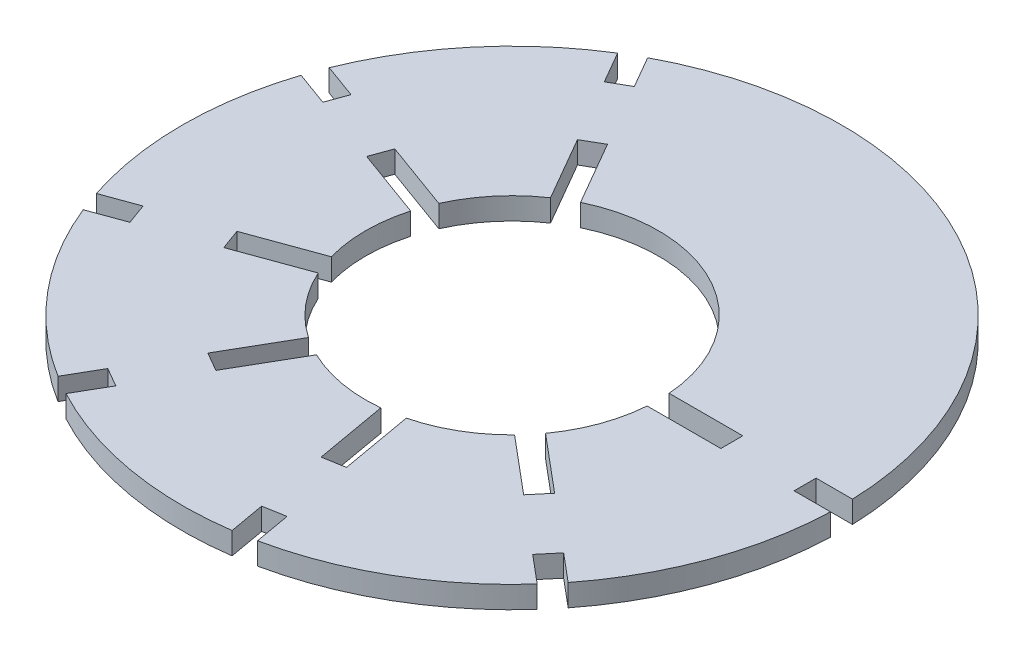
from build123d import *

# Parameters (mm, degrees)
SKETCH1_R           = 225
SKETCH1_R_2         = 100
BOSS_EXTRUDE1_DEPTH = 15
SKETCH2_W           = 50
SKETCH2_H           = 15
SKETCH2_W_2         = 55
CUT_EXTRUDE3_DEPTH  = 15


with BuildPart() as part:
    # Sketch1 → Boss-Extrude1 (new body)
    with BuildSketch(Plane(origin=(0, 0, 0), x_dir=(1, 0, 0), z_dir=(0, 1, 0))):
        with Locations(Location((0, 0, 0), (0, 0, 270))):
            Circle(SKETCH1_R)
        with Locations(Location((0, 0, 0), (0, 0, 270))):
            Circle(SKETCH1_R_2, mode=Mode.SUBTRACT)
    extrude(amount=BOSS_EXTRUDE1_DEPTH)

    # Sketch2 → Cut-Extrude3 (cut)
    with BuildSketch(Plane(origin=(0, 15, 0), x_dir=(1, 0, 0), z_dir=(0, 1, 0))):
        with Locations((225, 0)):
            Rectangle(SKETCH2_W, SKETCH2_H)
        with Locations((122.5, 0)):
            Rectangle(SKETCH2_W_2, SKETCH2_H)
        Polygon((148.387981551, -134.302855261), (186.690203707, -166.442235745), (196.332017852, -154.951569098), (158.029795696, -122.812188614), align=None)
        Polygon((67.953315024, -66.810156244), (110.085759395, -102.163474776), (119.72757354, -90.67280813), (77.595129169, -55.319489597), align=None)
        Polygon((42.115693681, -195.65918927), (50.798102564, -244.899576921), (36.025986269, -247.504299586), (27.343577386, -198.263911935), align=None)
        Polygon((23.882635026, -92.254375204), (33.433284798, -146.418801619), (18.661168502, -149.023524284), (9.110518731, -94.859097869), align=None)
        Polygon((-41.004809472, -86.02241336), (-68.504809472, -133.653810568), (-81.495190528, -126.153810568), (-53.995190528, -78.52241336), align=None)
        Polygon((-93.504809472, -176.955080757), (-118.504809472, -220.256350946), (-131.495190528, -212.756350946), (-106.495190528, -169.455080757), align=None)
        Polygon((-185.373373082, -75.451723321), (-232.358004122, -92.552730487), (-237.488306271, -78.457341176), (-190.503675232, -61.356334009), align=None)
        Polygon((-86.7056479, -39.539608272), (-138.388742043, -58.350716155), (-143.519044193, -44.255326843), (-91.83595005, -25.44421896), align=None)
        Polygon((-91.83595005, 25.44421896), (-143.519044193, 44.255326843), (-138.388742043, 58.350716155), (-86.7056479, 39.539608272), align=None)
        Polygon((-190.503675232, 61.356334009), (-237.488306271, 78.457341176), (-232.358004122, 92.552730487), (-185.373373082, 75.451723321), align=None)
        Polygon((-53.995190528, 78.52241336), (-81.495190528, 126.153810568), (-68.504809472, 133.653810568), (-41.004809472, 86.02241336), align=None)
        Polygon((-106.495190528, 169.455080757), (-131.495190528, 212.756350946), (-118.504809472, 220.256350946), (-93.504809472, 176.955080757), align=None)
    extrude(amount=-CUT_EXTRUDE3_DEPTH, mode=Mode.SUBTRACT)


solid = part.part
